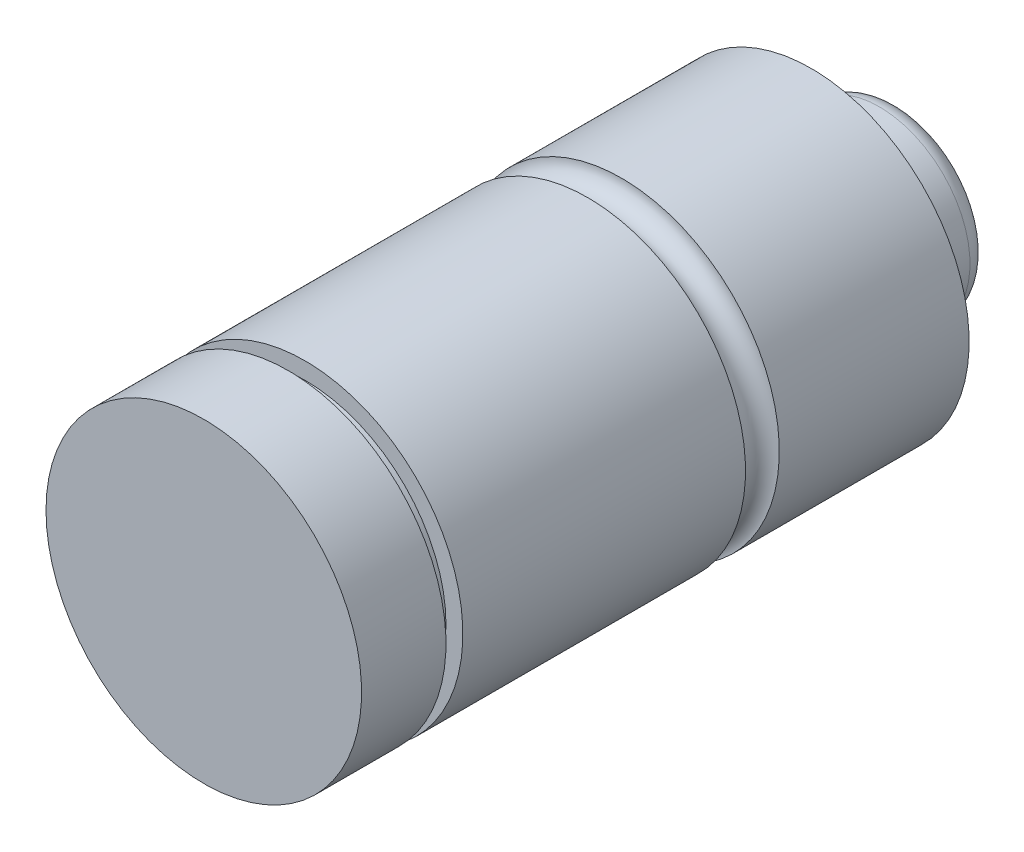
from build123d import *


with BuildPart() as part:
    # Logo3_bib1 → Revolve1 (revolve)
    with BuildSketch(Plane(origin=(0, 0, 0), x_dir=(-1, 0, 0), z_dir=(0, -1, 0))):
        with BuildLine():
            Line((0, 41.859), (0, 0))
            Line((0, 0), (9.4996, 0))
            Line((9.4996, 0), (9.4996, 5.08))
            Line((9.4996, 5.08), (8.4836, 5.08))
            Line((8.4836, 5.08), (8.4836, 6.096))
            Line((8.4836, 6.096), (9.4996, 6.096))
            Line((9.4996, 6.096), (9.4996, 23.114))
            ThreePointArc((9.4996, 23.114), (8.4836, 24.13), (9.4996, 25.146))
            Line((9.4996, 25.146), (9.4996, 36.576))
            Line((9.4996, 36.576), (5.461, 36.576))
            Line((5.461, 36.576), (5.461, 40.6652))
            ThreePointArc((5.461, 40.6652), (5.111344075, 41.509344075), (4.2672, 41.859))
            Line((4.2672, 41.859), (0, 41.859))
        make_face()
    revolve(axis=Axis((0, 0, -88.073796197), (0, 0, 1)))


solid = part.part
